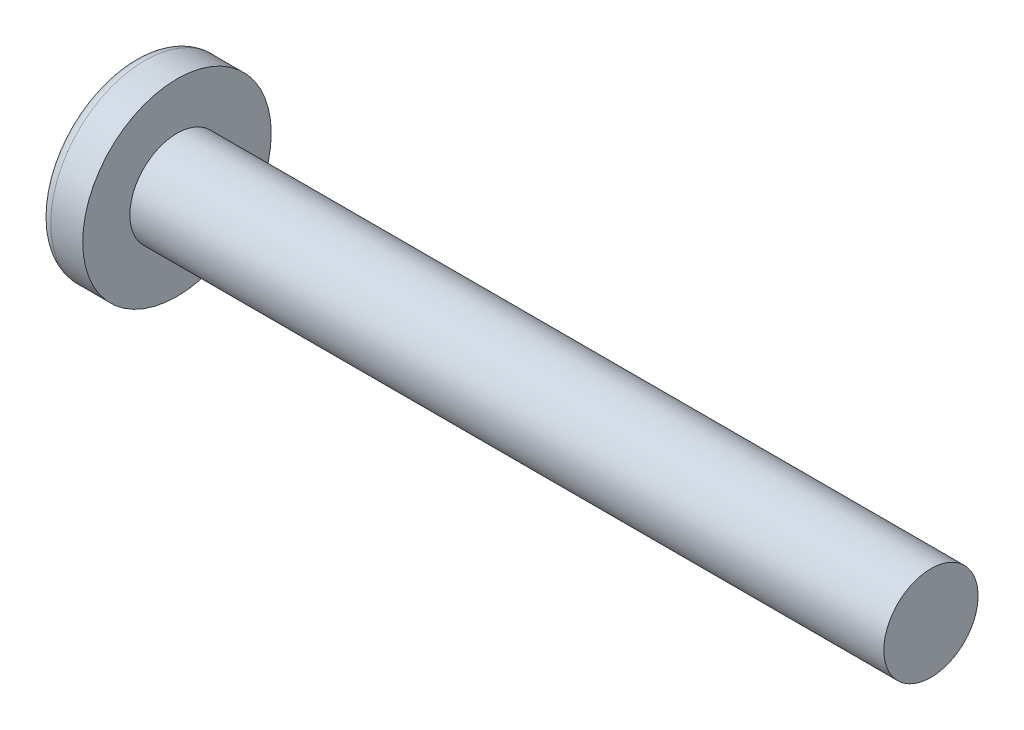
ISO-10303-21;
HEADER;
FILE_DESCRIPTION(('STEP AP214'),'2;1');
FILE_NAME('part.step','',(''),(''),'','','');
FILE_SCHEMA(('AUTOMOTIVE_DESIGN { 1 0 10303 214 1 1 1 1 }'));
ENDSEC;
DATA;
#1=APPLICATION_CONTEXT('core data for automotive mechanical design processes');
#2=APPLICATION_PROTOCOL_DEFINITION('international standard','automotive_design',2000,#1);
#3=PRODUCT_CONTEXT('',#1,'mechanical');
#4=PRODUCT('Part','Part','',(#3));
#5=PRODUCT_RELATED_PRODUCT_CATEGORY('part','',(#4));
#6=PRODUCT_DEFINITION_FORMATION('','',#4);
#7=PRODUCT_DEFINITION_CONTEXT('part definition',#1,'design');
#8=PRODUCT_DEFINITION('design','',#6,#7);
#9=PRODUCT_DEFINITION_SHAPE('','',#8);
#10=(LENGTH_UNIT() NAMED_UNIT(*) SI_UNIT(.MILLI.,.METRE.));
#11=(NAMED_UNIT(*) PLANE_ANGLE_UNIT() SI_UNIT($,.RADIAN.));
#12=(NAMED_UNIT(*) SI_UNIT($,.STERADIAN.) SOLID_ANGLE_UNIT());
#13=UNCERTAINTY_MEASURE_WITH_UNIT(LENGTH_MEASURE(1.E-05),#10,'distance_accuracy_value','');
#14=(GEOMETRIC_REPRESENTATION_CONTEXT(3) GLOBAL_UNCERTAINTY_ASSIGNED_CONTEXT((#13)) GLOBAL_UNIT_ASSIGNED_CONTEXT((#10,
#11,#12)) REPRESENTATION_CONTEXT('',''));
#15=CARTESIAN_POINT('',(0.,0.,0.));
#16=DIRECTION('',(0.,0.,1.));
#17=DIRECTION('',(1.,0.,0.));
#18=AXIS2_PLACEMENT_3D('',#15,#16,#17);
#19=CARTESIAN_POINT('',(16.,0.,0.));
#20=DIRECTION('',(-1.,0.,0.));
#21=DIRECTION('',(0.,1.,0.));
#22=AXIS2_PLACEMENT_3D('',#19,#20,#21);
#23=SPHERICAL_SURFACE('',#22,16.);
#24=CARTESIAN_POINT('',(3.13558937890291,0.,0.));
#25=DIRECTION('',(-1.,0.,0.));
#26=DIRECTION('',(0.,0.,1.));
#27=AXIS2_PLACEMENT_3D('',#24,#25,#26);
#28=CIRCLE('',#27,9.51351351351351);
#29=CARTESIAN_POINT('',(3.13558937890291,0.,9.51351351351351));
#30=VERTEX_POINT('',#29);
#31=EDGE_CURVE('E150',#30,#30,#28,.T.);
#32=ORIENTED_EDGE('',*,*,#31,.T.);
#33=EDGE_LOOP('',(#32));
#34=FACE_BOUND('',#33,.T.);
#35=CARTESIAN_POINT('',(15.9783292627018,-0.286901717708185,0.));
#36=DIRECTION('',(-0.0753191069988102,-0.997159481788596,0.));
#37=DIRECTION('',(0.997159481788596,-0.0753191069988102,0.));
#38=AXIS2_PLACEMENT_3D('',#35,#36,#37);
#39=CIRCLE('',#38,15.9974128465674);
#40=CARTESIAN_POINT('',(0.689797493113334,0.867897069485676,4.56557267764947));
#41=VERTEX_POINT('',#40);
#42=CARTESIAN_POINT('',(0.0525309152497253,0.916032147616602,0.916032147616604));
#43=VERTEX_POINT('',#42);
#44=EDGE_CURVE('E181',#41,#43,#39,.T.);
#45=ORIENTED_EDGE('',*,*,#44,.F.);
#46=CARTESIAN_POINT('',(12.5917266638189,0.,-4.48302043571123));
#47=DIRECTION('',(0.605215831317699,0.,0.796061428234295));
#48=DIRECTION('',(0.796061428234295,0.,-0.605215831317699));
#49=AXIS2_PLACEMENT_3D('',#46,#47,#48);
#50=CIRCLE('',#49,14.9761877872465);
#51=CARTESIAN_POINT('',(0.689797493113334,-0.867897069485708,4.56557267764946));
#52=VERTEX_POINT('',#51);
#53=EDGE_CURVE('E146',#41,#52,#50,.T.);
#54=ORIENTED_EDGE('',*,*,#53,.T.);
#55=CARTESIAN_POINT('',(15.9783292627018,0.286901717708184,0.));
#56=DIRECTION('',(-0.0753191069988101,0.997159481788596,0.));
#57=DIRECTION('',(-0.997159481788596,-0.0753191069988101,0.));
#58=AXIS2_PLACEMENT_3D('',#55,#56,#57);
#59=CIRCLE('',#58,15.9974128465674);
#60=CARTESIAN_POINT('',(0.0525309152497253,-0.916032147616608,0.916032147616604));
#61=VERTEX_POINT('',#60);
#62=EDGE_CURVE('E102',#61,#52,#59,.T.);
#63=ORIENTED_EDGE('',*,*,#62,.F.);
#64=CARTESIAN_POINT('',(15.9783292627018,0.,-0.286901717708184));
#65=DIRECTION('',(-0.0753191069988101,0.,-0.997159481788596));
#66=DIRECTION('',(-0.997159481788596,0.,0.0753191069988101));
#67=AXIS2_PLACEMENT_3D('',#64,#65,#66);
#68=CIRCLE('',#67,15.9974128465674);
#69=CARTESIAN_POINT('',(0.68979749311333,-4.56557267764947,0.867897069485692));
#70=VERTEX_POINT('',#69);
#71=EDGE_CURVE('E127',#70,#61,#68,.T.);
#72=ORIENTED_EDGE('',*,*,#71,.F.);
#73=CARTESIAN_POINT('',(12.5917266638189,4.48302043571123,0.));
#74=DIRECTION('',(0.605215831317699,-0.796061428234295,0.));
#75=DIRECTION('',(0.796061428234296,0.605215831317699,0.));
#76=AXIS2_PLACEMENT_3D('',#73,#74,#75);
#77=CIRCLE('',#76,14.9761877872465);
#78=CARTESIAN_POINT('',(0.689797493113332,-4.56557267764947,-0.867897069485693));
#79=VERTEX_POINT('',#78);
#80=EDGE_CURVE('E135',#70,#79,#77,.T.);
#81=ORIENTED_EDGE('',*,*,#80,.T.);
#82=CARTESIAN_POINT('',(15.9783292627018,0.,0.286901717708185));
#83=DIRECTION('',(-0.0753191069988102,0.,0.997159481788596));
#84=DIRECTION('',(0.997159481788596,0.,0.0753191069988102));
#85=AXIS2_PLACEMENT_3D('',#82,#83,#84);
#86=CIRCLE('',#85,15.9974128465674);
#87=CARTESIAN_POINT('',(0.0525309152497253,-0.916032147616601,-0.916032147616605));
#88=VERTEX_POINT('',#87);
#89=EDGE_CURVE('E45',#88,#79,#86,.T.);
#90=ORIENTED_EDGE('',*,*,#89,.F.);
#91=CARTESIAN_POINT('',(0.68979749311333,-0.867897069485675,-4.56557267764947));
#92=VERTEX_POINT('',#91);
#93=EDGE_CURVE('E188',#92,#88,#59,.T.);
#94=ORIENTED_EDGE('',*,*,#93,.F.);
#95=CARTESIAN_POINT('',(12.5917266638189,0.,4.48302043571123));
#96=DIRECTION('',(0.605215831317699,0.,-0.796061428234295));
#97=DIRECTION('',(-0.796061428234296,0.,-0.605215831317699));
#98=AXIS2_PLACEMENT_3D('',#95,#96,#97);
#99=CIRCLE('',#98,14.9761877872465);
#100=CARTESIAN_POINT('',(0.689797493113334,0.867897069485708,-4.56557267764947));
#101=VERTEX_POINT('',#100);
#102=EDGE_CURVE('E128',#92,#101,#99,.T.);
#103=ORIENTED_EDGE('',*,*,#102,.T.);
#104=CARTESIAN_POINT('',(0.0525309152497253,0.916032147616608,-0.916032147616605));
#105=VERTEX_POINT('',#104);
#106=EDGE_CURVE('E176',#105,#101,#39,.T.);
#107=ORIENTED_EDGE('',*,*,#106,.F.);
#108=CARTESIAN_POINT('',(0.689797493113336,4.56557267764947,-0.867897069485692));
#109=VERTEX_POINT('',#108);
#110=EDGE_CURVE('E38',#109,#105,#86,.T.);
#111=ORIENTED_EDGE('',*,*,#110,.F.);
#112=CARTESIAN_POINT('',(12.5917266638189,-4.48302043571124,0.));
#113=DIRECTION('',(0.605215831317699,0.796061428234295,0.));
#114=DIRECTION('',(-0.796061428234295,0.605215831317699,0.));
#115=AXIS2_PLACEMENT_3D('',#112,#113,#114);
#116=CIRCLE('',#115,14.9761877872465);
#117=CARTESIAN_POINT('',(0.689797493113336,4.56557267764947,0.867897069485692));
#118=VERTEX_POINT('',#117);
#119=EDGE_CURVE('E11',#109,#118,#116,.T.);
#120=ORIENTED_EDGE('',*,*,#119,.T.);
#121=EDGE_CURVE('E164',#43,#118,#68,.T.);
#122=ORIENTED_EDGE('',*,*,#121,.F.);
#123=EDGE_LOOP('',(#45,#54,#63,#72,#81,#90,#94,#103,#107,#111,#120,#122));
#124=FACE_BOUND('',#123,.T.);
#125=ADVANCED_FACE('F30',(#34,#124),#23,.T.);
#126=CARTESIAN_POINT('',(6.69505399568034,0.,-0.414298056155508));
#127=DIRECTION('',(-0.0753191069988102,0.,0.997159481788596));
#128=DIRECTION('',(0.997159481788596,0.,0.0753191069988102));
#129=AXIS2_PLACEMENT_3D('',#126,#127,#128);
#130=PLANE('',#129);
#131=ORIENTED_EDGE('',*,*,#110,.T.);
#132=DIRECTION('',(0.994343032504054,-0.0751063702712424,0.0751063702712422));
#133=VECTOR('',#132,1.);
#134=CARTESIAN_POINT('',(6.72599439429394,0.411961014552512,-0.41196101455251));
#135=LINE('',#134,#133);
#136=CARTESIAN_POINT('',(6.09,0.460000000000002,-0.459999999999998));
#137=VERTEX_POINT('',#136);
#138=EDGE_CURVE('E170',#105,#137,#135,.T.);
#139=ORIENTED_EDGE('',*,*,#138,.T.);
#140=DIRECTION('',(0.794626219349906,-0.60412469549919,0.0600210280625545));
#141=VECTOR('',#140,1.);
#142=CARTESIAN_POINT('',(0.,5.09,-0.92));
#143=LINE('',#142,#141);
#144=EDGE_CURVE('E151',#109,#137,#143,.T.);
#145=ORIENTED_EDGE('',*,*,#144,.F.);
#146=EDGE_LOOP('',(#131,#139,#145));
#147=FACE_BOUND('',#146,.T.);
#148=ADVANCED_FACE('F169',(#147),#130,.T.);
#149=DIRECTION('',(0.794626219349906,0.60412469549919,0.0600210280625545));
#150=VECTOR('',#149,1.);
#151=CARTESIAN_POINT('',(0.,-5.09,-0.92));
#152=LINE('',#151,#150);
#153=CARTESIAN_POINT('',(6.09,-0.46,-0.46));
#154=VERTEX_POINT('',#153);
#155=EDGE_CURVE('E136',#79,#154,#152,.T.);
#156=ORIENTED_EDGE('',*,*,#155,.T.);
#157=DIRECTION('',(-0.994343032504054,-0.0751063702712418,-0.0751063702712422));
#158=VECTOR('',#157,1.);
#159=CARTESIAN_POINT('',(6.72599439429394,-0.411961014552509,-0.411961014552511));
#160=LINE('',#159,#158);
#161=EDGE_CURVE('E191',#154,#88,#160,.T.);
#162=ORIENTED_EDGE('',*,*,#161,.T.);
#163=ORIENTED_EDGE('',*,*,#89,.T.);
#164=EDGE_LOOP('',(#156,#162,#163));
#165=FACE_BOUND('',#164,.T.);
#166=ADVANCED_FACE('F206',(#165),#130,.T.);
#167=CARTESIAN_POINT('',(6.69505399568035,0.,0.414298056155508));
#168=DIRECTION('',(-0.0753191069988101,0.,-0.997159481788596));
#169=DIRECTION('',(-0.997159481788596,0.,0.0753191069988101));
#170=AXIS2_PLACEMENT_3D('',#167,#168,#169);
#171=PLANE('',#170);
#172=DIRECTION('',(0.794626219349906,-0.60412469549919,-0.0600210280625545));
#173=VECTOR('',#172,1.);
#174=CARTESIAN_POINT('',(0.,5.09,0.92));
#175=LINE('',#174,#173);
#176=CARTESIAN_POINT('',(6.09,0.46,0.46));
#177=VERTEX_POINT('',#176);
#178=EDGE_CURVE('E207',#118,#177,#175,.T.);
#179=ORIENTED_EDGE('',*,*,#178,.T.);
#180=DIRECTION('',(-0.994343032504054,0.0751063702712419,0.0751063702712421));
#181=VECTOR('',#180,1.);
#182=CARTESIAN_POINT('',(6.72599439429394,0.411961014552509,0.41196101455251));
#183=LINE('',#182,#181);
#184=EDGE_CURVE('E185',#177,#43,#183,.T.);
#185=ORIENTED_EDGE('',*,*,#184,.T.);
#186=ORIENTED_EDGE('',*,*,#121,.T.);
#187=EDGE_LOOP('',(#179,#185,#186));
#188=FACE_BOUND('',#187,.T.);
#189=ADVANCED_FACE('F211',(#188),#171,.T.);
#190=ORIENTED_EDGE('',*,*,#71,.T.);
#191=DIRECTION('',(0.994343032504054,0.0751063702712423,-0.075106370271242));
#192=VECTOR('',#191,1.);
#193=CARTESIAN_POINT('',(6.72599439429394,-0.411961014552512,0.41196101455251));
#194=LINE('',#193,#192);
#195=CARTESIAN_POINT('',(6.09,-0.460000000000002,0.459999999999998));
#196=VERTEX_POINT('',#195);
#197=EDGE_CURVE('E100',#61,#196,#194,.T.);
#198=ORIENTED_EDGE('',*,*,#197,.T.);
#199=DIRECTION('',(0.794626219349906,0.60412469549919,-0.0600210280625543));
#200=VECTOR('',#199,1.);
#201=CARTESIAN_POINT('',(0.,-5.09,0.919999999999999));
#202=LINE('',#201,#200);
#203=EDGE_CURVE('E125',#70,#196,#202,.T.);
#204=ORIENTED_EDGE('',*,*,#203,.F.);
#205=EDGE_LOOP('',(#190,#198,#204));
#206=FACE_BOUND('',#205,.T.);
#207=ADVANCED_FACE('F124',(#206),#171,.T.);
#208=CARTESIAN_POINT('',(-25.4,0.,0.));
#209=DIRECTION('',(-1.,0.,0.));
#210=DIRECTION('',(0.,0.,1.));
#211=AXIS2_PLACEMENT_3D('',#208,#209,#210);
#212=CYLINDRICAL_SURFACE('',#211,5.);
#213=CARTESIAN_POINT('',(87.5,0.,0.));
#214=DIRECTION('',(-1.,0.,0.));
#215=DIRECTION('',(0.,0.,1.));
#216=AXIS2_PLACEMENT_3D('',#213,#214,#215);
#217=CIRCLE('',#216,5.);
#218=CARTESIAN_POINT('',(87.5,0.,5.));
#219=VERTEX_POINT('',#218);
#220=EDGE_CURVE('E147',#219,#219,#217,.T.);
#221=ORIENTED_EDGE('',*,*,#220,.T.);
#222=EDGE_LOOP('',(#221));
#223=FACE_BOUND('',#222,.T.);
#224=CARTESIAN_POINT('',(7.5,0.,0.));
#225=DIRECTION('',(-1.,0.,0.));
#226=DIRECTION('',(0.,0.,1.));
#227=AXIS2_PLACEMENT_3D('',#224,#225,#226);
#228=CIRCLE('',#227,5.);
#229=CARTESIAN_POINT('',(7.5,0.,5.));
#230=VERTEX_POINT('',#229);
#231=EDGE_CURVE('E160',#230,#230,#228,.T.);
#232=ORIENTED_EDGE('',*,*,#231,.F.);
#233=EDGE_LOOP('',(#232));
#234=FACE_BOUND('',#233,.T.);
#235=ADVANCED_FACE('F32',(#223,#234),#212,.T.);
#236=CARTESIAN_POINT('',(7.5,5.,0.));
#237=DIRECTION('',(-1.,0.,0.));
#238=DIRECTION('',(0.,0.,1.));
#239=AXIS2_PLACEMENT_3D('',#236,#237,#238);
#240=PLANE('',#239);
#241=CARTESIAN_POINT('',(7.5,0.,0.));
#242=DIRECTION('',(-1.,0.,0.));
#243=DIRECTION('',(0.,0.,1.));
#244=AXIS2_PLACEMENT_3D('',#241,#242,#243);
#245=CIRCLE('',#244,10.);
#246=CARTESIAN_POINT('',(7.5,0.,10.));
#247=VERTEX_POINT('',#246);
#248=EDGE_CURVE('E157',#247,#247,#245,.T.);
#249=ORIENTED_EDGE('',*,*,#248,.F.);
#250=EDGE_LOOP('',(#249));
#251=FACE_BOUND('',#250,.T.);
#252=ORIENTED_EDGE('',*,*,#231,.T.);
#253=EDGE_LOOP('',(#252));
#254=FACE_BOUND('',#253,.T.);
#255=ADVANCED_FACE('F239',(#251,#254),#240,.F.);
#256=CARTESIAN_POINT('',(-25.4,0.,0.));
#257=DIRECTION('',(-1.,0.,0.));
#258=DIRECTION('',(0.,0.,1.));
#259=AXIS2_PLACEMENT_3D('',#256,#257,#258);
#260=CYLINDRICAL_SURFACE('',#259,10.);
#261=ORIENTED_EDGE('',*,*,#248,.T.);
#262=EDGE_LOOP('',(#261));
#263=FACE_BOUND('',#262,.T.);
#264=CARTESIAN_POINT('',(4.10042017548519,0.,0.));
#265=DIRECTION('',(-1.,0.,0.));
#266=DIRECTION('',(0.,0.,1.));
#267=AXIS2_PLACEMENT_3D('',#264,#265,#266);
#268=CIRCLE('',#267,10.);
#269=CARTESIAN_POINT('',(4.10042017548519,0.,10.));
#270=VERTEX_POINT('',#269);
#271=EDGE_CURVE('E154',#270,#270,#268,.T.);
#272=ORIENTED_EDGE('',*,*,#271,.F.);
#273=EDGE_LOOP('',(#272));
#274=FACE_BOUND('',#273,.T.);
#275=ADVANCED_FACE('F236',(#263,#274),#260,.T.);
#276=CARTESIAN_POINT('',(4.10042017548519,0.,0.));
#277=DIRECTION('',(-1.,0.,0.));
#278=DIRECTION('',(0.,0.,1.));
#279=AXIS2_PLACEMENT_3D('',#276,#277,#278);
#280=TOROIDAL_SURFACE('',#279,8.8,1.2);
#281=ORIENTED_EDGE('',*,*,#271,.T.);
#282=EDGE_LOOP('',(#281));
#283=FACE_BOUND('',#282,.T.);
#284=ORIENTED_EDGE('',*,*,#31,.F.);
#285=EDGE_LOOP('',(#284));
#286=FACE_BOUND('',#285,.T.);
#287=ADVANCED_FACE('F233',(#283,#286),#280,.T.);
#288=CARTESIAN_POINT('',(87.5,5.,0.));
#289=DIRECTION('',(1.,0.,0.));
#290=DIRECTION('',(0.,0.,-1.));
#291=AXIS2_PLACEMENT_3D('',#288,#289,#290);
#292=PLANE('',#291);
#293=ORIENTED_EDGE('',*,*,#220,.F.);
#294=EDGE_LOOP('',(#293));
#295=FACE_BOUND('',#294,.T.);
#296=ADVANCED_FACE('F231',(#295),#292,.T.);
#297=CARTESIAN_POINT('',(6.09,0.46,0.46));
#298=DIRECTION('',(0.605215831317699,0.796061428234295,0.));
#299=DIRECTION('',(-0.796061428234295,0.605215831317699,0.));
#300=AXIS2_PLACEMENT_3D('',#297,#298,#299);
#301=PLANE('',#300);
#302=ORIENTED_EDGE('',*,*,#144,.T.);
#303=DIRECTION('',(0.,0.,-1.));
#304=VECTOR('',#303,1.);
#305=CARTESIAN_POINT('',(6.09,0.46,0.46));
#306=LINE('',#305,#304);
#307=EDGE_CURVE('E118',#177,#137,#306,.T.);
#308=ORIENTED_EDGE('',*,*,#307,.F.);
#309=ORIENTED_EDGE('',*,*,#178,.F.);
#310=ORIENTED_EDGE('',*,*,#119,.F.);
#311=EDGE_LOOP('',(#302,#308,#309,#310));
#312=FACE_BOUND('',#311,.T.);
#313=ADVANCED_FACE('F210',(#312),#301,.F.);
#314=CARTESIAN_POINT('',(6.09,-0.46,-0.46));
#315=DIRECTION('',(0.605215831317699,-0.796061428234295,0.));
#316=DIRECTION('',(0.796061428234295,0.605215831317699,0.));
#317=AXIS2_PLACEMENT_3D('',#314,#315,#316);
#318=PLANE('',#317);
#319=ORIENTED_EDGE('',*,*,#203,.T.);
#320=DIRECTION('',(0.,0.,1.));
#321=VECTOR('',#320,1.);
#322=CARTESIAN_POINT('',(6.09,-0.46,-0.46));
#323=LINE('',#322,#321);
#324=EDGE_CURVE('E117',#154,#196,#323,.T.);
#325=ORIENTED_EDGE('',*,*,#324,.F.);
#326=ORIENTED_EDGE('',*,*,#155,.F.);
#327=ORIENTED_EDGE('',*,*,#80,.F.);
#328=EDGE_LOOP('',(#319,#325,#326,#327));
#329=FACE_BOUND('',#328,.T.);
#330=ADVANCED_FACE('F132',(#329),#318,.F.);
#331=CARTESIAN_POINT('',(6.09,0.46,-0.46));
#332=DIRECTION('',(-1.,0.,0.));
#333=DIRECTION('',(0.,0.,1.));
#334=AXIS2_PLACEMENT_3D('',#331,#332,#333);
#335=PLANE('',#334);
#336=DIRECTION('',(0.,1.,0.));
#337=VECTOR('',#336,1.);
#338=CARTESIAN_POINT('',(6.09,-0.46,-0.46));
#339=LINE('',#338,#337);
#340=EDGE_CURVE('E140',#154,#137,#339,.T.);
#341=ORIENTED_EDGE('',*,*,#340,.F.);
#342=ORIENTED_EDGE('',*,*,#324,.T.);
#343=DIRECTION('',(0.,-1.,0.));
#344=VECTOR('',#343,1.);
#345=CARTESIAN_POINT('',(6.09,0.46,0.46));
#346=LINE('',#345,#344);
#347=EDGE_CURVE('E109',#177,#196,#346,.T.);
#348=ORIENTED_EDGE('',*,*,#347,.F.);
#349=ORIENTED_EDGE('',*,*,#307,.T.);
#350=EDGE_LOOP('',(#341,#342,#348,#349));
#351=FACE_BOUND('',#350,.T.);
#352=ADVANCED_FACE('F138',(#351),#335,.T.);
#353=CARTESIAN_POINT('',(6.09,0.460000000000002,-0.459999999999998));
#354=DIRECTION('',(0.605215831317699,0.,-0.796061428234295));
#355=DIRECTION('',(0.796061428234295,0.,0.605215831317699));
#356=AXIS2_PLACEMENT_3D('',#353,#354,#355);
#357=PLANE('',#356);
#358=DIRECTION('',(0.794626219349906,0.0600210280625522,0.60412469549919));
#359=VECTOR('',#358,1.);
#360=CARTESIAN_POINT('',(0.,-0.919999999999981,-5.09));
#361=LINE('',#360,#359);
#362=EDGE_CURVE('E196',#92,#154,#361,.T.);
#363=ORIENTED_EDGE('',*,*,#362,.T.);
#364=ORIENTED_EDGE('',*,*,#340,.T.);
#365=DIRECTION('',(0.794626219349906,-0.0600210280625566,0.60412469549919));
#366=VECTOR('',#365,1.);
#367=CARTESIAN_POINT('',(0.,0.920000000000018,-5.09));
#368=LINE('',#367,#366);
#369=EDGE_CURVE('E106',#101,#137,#368,.T.);
#370=ORIENTED_EDGE('',*,*,#369,.F.);
#371=ORIENTED_EDGE('',*,*,#102,.F.);
#372=EDGE_LOOP('',(#363,#364,#370,#371));
#373=FACE_BOUND('',#372,.T.);
#374=ADVANCED_FACE('F201',(#373),#357,.F.);
#375=CARTESIAN_POINT('',(6.69505399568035,-0.414298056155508,0.));
#376=DIRECTION('',(-0.0753191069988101,0.997159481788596,0.));
#377=DIRECTION('',(-0.997159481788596,-0.0753191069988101,0.));
#378=AXIS2_PLACEMENT_3D('',#375,#376,#377);
#379=PLANE('',#378);
#380=ORIENTED_EDGE('',*,*,#93,.T.);
#381=ORIENTED_EDGE('',*,*,#161,.F.);
#382=ORIENTED_EDGE('',*,*,#362,.F.);
#383=EDGE_LOOP('',(#380,#381,#382));
#384=FACE_BOUND('',#383,.T.);
#385=ADVANCED_FACE('F205',(#384),#379,.T.);
#386=CARTESIAN_POINT('',(6.69505399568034,0.414298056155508,0.));
#387=DIRECTION('',(-0.0753191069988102,-0.997159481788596,0.));
#388=DIRECTION('',(0.997159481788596,-0.0753191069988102,0.));
#389=AXIS2_PLACEMENT_3D('',#386,#387,#388);
#390=PLANE('',#389);
#391=ORIENTED_EDGE('',*,*,#106,.T.);
#392=ORIENTED_EDGE('',*,*,#369,.T.);
#393=ORIENTED_EDGE('',*,*,#138,.F.);
#394=EDGE_LOOP('',(#391,#392,#393));
#395=FACE_BOUND('',#394,.T.);
#396=ADVANCED_FACE('F199',(#395),#390,.T.);
#397=CARTESIAN_POINT('',(6.09,-0.460000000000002,0.459999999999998));
#398=DIRECTION('',(0.605215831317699,0.,0.796061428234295));
#399=DIRECTION('',(-0.796061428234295,0.,0.605215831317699));
#400=AXIS2_PLACEMENT_3D('',#397,#398,#399);
#401=PLANE('',#400);
#402=DIRECTION('',(0.794626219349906,-0.0600210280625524,-0.60412469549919));
#403=VECTOR('',#402,1.);
#404=CARTESIAN_POINT('',(0.,0.919999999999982,5.09));
#405=LINE('',#404,#403);
#406=EDGE_CURVE('E105',#41,#177,#405,.T.);
#407=ORIENTED_EDGE('',*,*,#406,.T.);
#408=ORIENTED_EDGE('',*,*,#347,.T.);
#409=DIRECTION('',(0.794626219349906,0.0600210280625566,-0.60412469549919));
#410=VECTOR('',#409,1.);
#411=CARTESIAN_POINT('',(0.,-0.920000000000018,5.09));
#412=LINE('',#411,#410);
#413=EDGE_CURVE('E96',#52,#196,#412,.T.);
#414=ORIENTED_EDGE('',*,*,#413,.F.);
#415=ORIENTED_EDGE('',*,*,#53,.F.);
#416=EDGE_LOOP('',(#407,#408,#414,#415));
#417=FACE_BOUND('',#416,.T.);
#418=ADVANCED_FACE('F110',(#417),#401,.F.);
#419=ORIENTED_EDGE('',*,*,#44,.T.);
#420=ORIENTED_EDGE('',*,*,#184,.F.);
#421=ORIENTED_EDGE('',*,*,#406,.F.);
#422=EDGE_LOOP('',(#419,#420,#421));
#423=FACE_BOUND('',#422,.T.);
#424=ADVANCED_FACE('F212',(#423),#390,.T.);
#425=ORIENTED_EDGE('',*,*,#62,.T.);
#426=ORIENTED_EDGE('',*,*,#413,.T.);
#427=ORIENTED_EDGE('',*,*,#197,.F.);
#428=EDGE_LOOP('',(#425,#426,#427));
#429=FACE_BOUND('',#428,.T.);
#430=ADVANCED_FACE('F98',(#429),#379,.T.);
#431=CLOSED_SHELL('',(#125,#148,#166,#189,#207,#235,#255,#275,#287,#296,#313,#330,#352,#374,
#385,#396,#418,#424,#430));
#432=MANIFOLD_SOLID_BREP('B2',#431);
#433=ADVANCED_BREP_SHAPE_REPRESENTATION('',(#18,#432),#14);
#434=SHAPE_DEFINITION_REPRESENTATION(#9,#433);
ENDSEC;
END-ISO-10303-21;
